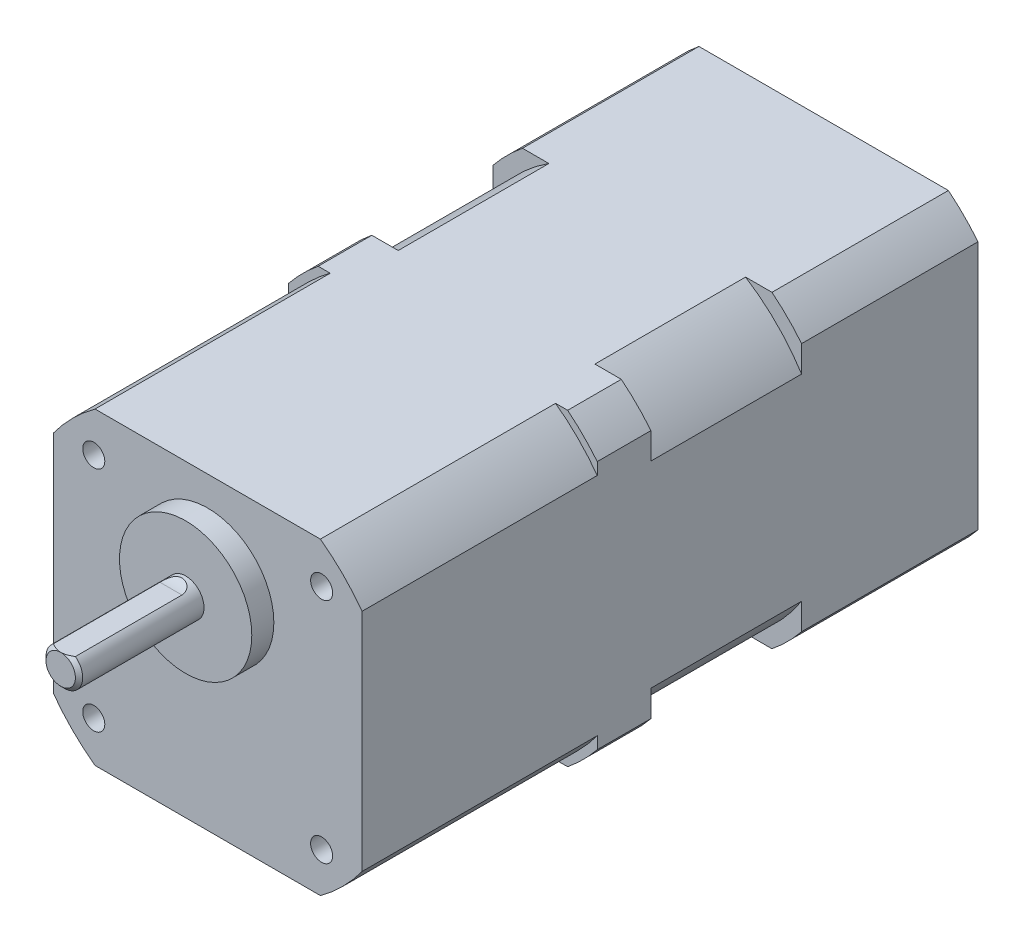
ISO-10303-21;
HEADER;
FILE_DESCRIPTION(('STEP AP214'),'2;1');
FILE_NAME('part.step','',(''),(''),'','','');
FILE_SCHEMA(('AUTOMOTIVE_DESIGN { 1 0 10303 214 1 1 1 1 }'));
ENDSEC;
DATA;
#1=APPLICATION_CONTEXT('core data for automotive mechanical design processes');
#2=APPLICATION_PROTOCOL_DEFINITION('international standard','automotive_design',2000,#1);
#3=PRODUCT_CONTEXT('',#1,'mechanical');
#4=PRODUCT('Part','Part','',(#3));
#5=PRODUCT_RELATED_PRODUCT_CATEGORY('part','',(#4));
#6=PRODUCT_DEFINITION_FORMATION('','',#4);
#7=PRODUCT_DEFINITION_CONTEXT('part definition',#1,'design');
#8=PRODUCT_DEFINITION('design','',#6,#7);
#9=PRODUCT_DEFINITION_SHAPE('','',#8);
#10=(LENGTH_UNIT() NAMED_UNIT(*) SI_UNIT(.MILLI.,.METRE.));
#11=(NAMED_UNIT(*) PLANE_ANGLE_UNIT() SI_UNIT($,.RADIAN.));
#12=(NAMED_UNIT(*) SI_UNIT($,.STERADIAN.) SOLID_ANGLE_UNIT());
#13=UNCERTAINTY_MEASURE_WITH_UNIT(LENGTH_MEASURE(1.E-05),#10,'distance_accuracy_value','');
#14=(GEOMETRIC_REPRESENTATION_CONTEXT(3) GLOBAL_UNCERTAINTY_ASSIGNED_CONTEXT((#13)) GLOBAL_UNIT_ASSIGNED_CONTEXT((#10,
#11,#12)) REPRESENTATION_CONTEXT('',''));
#15=CARTESIAN_POINT('',(0.,0.,0.));
#16=DIRECTION('',(0.,0.,1.));
#17=DIRECTION('',(1.,0.,0.));
#18=AXIS2_PLACEMENT_3D('',#15,#16,#17);
#19=CARTESIAN_POINT('',(0.,0.,-39.3));
#20=DIRECTION('',(0.,0.,-1.));
#21=DIRECTION('',(-1.,0.,0.));
#22=AXIS2_PLACEMENT_3D('',#19,#20,#21);
#23=PLANE('',#22);
#24=CARTESIAN_POINT('',(0.,-8.,-39.3));
#25=DIRECTION('',(0.,0.,-1.));
#26=DIRECTION('',(-1.,0.,0.));
#27=AXIS2_PLACEMENT_3D('',#24,#25,#26);
#28=CIRCLE('',#27,24.9);
#29=CARTESIAN_POINT('',(-13.3794618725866,-29.,-39.3));
#30=VERTEX_POINT('',#29);
#31=CARTESIAN_POINT('',(-21.,-21.3794618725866,-39.3));
#32=VERTEX_POINT('',#31);
#33=EDGE_CURVE('E402',#30,#32,#28,.T.);
#34=ORIENTED_EDGE('',*,*,#33,.F.);
#35=DIRECTION('',(-1.,0.,0.));
#36=VECTOR('',#35,1.);
#37=CARTESIAN_POINT('',(0.,-29.,-39.3));
#38=LINE('',#37,#36);
#39=CARTESIAN_POINT('',(-16.9705627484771,-29.,-39.3));
#40=VERTEX_POINT('',#39);
#41=EDGE_CURVE('E433',#30,#40,#38,.T.);
#42=ORIENTED_EDGE('',*,*,#41,.T.);
#43=CARTESIAN_POINT('',(0.,-8.,-39.3));
#44=DIRECTION('',(0.,0.,-1.));
#45=DIRECTION('',(-1.,0.,0.));
#46=AXIS2_PLACEMENT_3D('',#43,#44,#45);
#47=CIRCLE('',#46,27.);
#48=CARTESIAN_POINT('',(-21.,-24.9705627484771,-39.3));
#49=VERTEX_POINT('',#48);
#50=EDGE_CURVE('E432',#40,#49,#47,.T.);
#51=ORIENTED_EDGE('',*,*,#50,.T.);
#52=DIRECTION('',(0.,1.,0.));
#53=VECTOR('',#52,1.);
#54=CARTESIAN_POINT('',(-21.,0.,-39.3));
#55=LINE('',#54,#53);
#56=EDGE_CURVE('E436',#49,#32,#55,.T.);
#57=ORIENTED_EDGE('',*,*,#56,.T.);
#58=EDGE_LOOP('',(#34,#42,#51,#57));
#59=FACE_BOUND('',#58,.T.);
#60=ADVANCED_FACE('F87',(#59),#23,.T.);
#61=CARTESIAN_POINT('',(21.,-21.3794618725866,-39.3));
#62=VERTEX_POINT('',#61);
#63=CARTESIAN_POINT('',(13.3794618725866,-29.,-39.3));
#64=VERTEX_POINT('',#63);
#65=EDGE_CURVE('E687',#62,#64,#28,.T.);
#66=ORIENTED_EDGE('',*,*,#65,.F.);
#67=DIRECTION('',(0.,-1.,0.));
#68=VECTOR('',#67,1.);
#69=CARTESIAN_POINT('',(21.,0.,-39.3));
#70=LINE('',#69,#68);
#71=CARTESIAN_POINT('',(21.,-24.9705627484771,-39.3));
#72=VERTEX_POINT('',#71);
#73=EDGE_CURVE('E445',#62,#72,#70,.T.);
#74=ORIENTED_EDGE('',*,*,#73,.T.);
#75=CARTESIAN_POINT('',(0.,-8.,-39.3));
#76=DIRECTION('',(0.,0.,-1.));
#77=DIRECTION('',(-1.,0.,0.));
#78=AXIS2_PLACEMENT_3D('',#75,#76,#77);
#79=CIRCLE('',#78,27.);
#80=CARTESIAN_POINT('',(16.9705627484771,-29.,-39.3));
#81=VERTEX_POINT('',#80);
#82=EDGE_CURVE('E448',#72,#81,#79,.T.);
#83=ORIENTED_EDGE('',*,*,#82,.T.);
#84=EDGE_CURVE('E430',#81,#64,#38,.T.);
#85=ORIENTED_EDGE('',*,*,#84,.T.);
#86=EDGE_LOOP('',(#66,#74,#83,#85));
#87=FACE_BOUND('',#86,.T.);
#88=ADVANCED_FACE('F736',(#87),#23,.T.);
#89=CARTESIAN_POINT('',(13.3794618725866,13.,-39.3));
#90=VERTEX_POINT('',#89);
#91=CARTESIAN_POINT('',(21.,5.37946187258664,-39.3));
#92=VERTEX_POINT('',#91);
#93=EDGE_CURVE('E103',#90,#92,#28,.T.);
#94=ORIENTED_EDGE('',*,*,#93,.F.);
#95=DIRECTION('',(1.,0.,0.));
#96=VECTOR('',#95,1.);
#97=CARTESIAN_POINT('',(0.,13.,-39.3));
#98=LINE('',#97,#96);
#99=CARTESIAN_POINT('',(16.9705627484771,13.,-39.3));
#100=VERTEX_POINT('',#99);
#101=EDGE_CURVE('E440',#90,#100,#98,.T.);
#102=ORIENTED_EDGE('',*,*,#101,.T.);
#103=CARTESIAN_POINT('',(0.,-8.,-39.3));
#104=DIRECTION('',(0.,0.,-1.));
#105=DIRECTION('',(-1.,0.,0.));
#106=AXIS2_PLACEMENT_3D('',#103,#104,#105);
#107=CIRCLE('',#106,27.);
#108=CARTESIAN_POINT('',(21.,8.97056274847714,-39.3));
#109=VERTEX_POINT('',#108);
#110=EDGE_CURVE('E443',#100,#109,#107,.T.);
#111=ORIENTED_EDGE('',*,*,#110,.T.);
#112=EDGE_CURVE('E446',#109,#92,#70,.T.);
#113=ORIENTED_EDGE('',*,*,#112,.T.);
#114=EDGE_LOOP('',(#94,#102,#111,#113));
#115=FACE_BOUND('',#114,.T.);
#116=ADVANCED_FACE('F617',(#115),#23,.T.);
#117=CARTESIAN_POINT('',(0.,0.,3.));
#118=DIRECTION('',(0.,0.,-1.));
#119=DIRECTION('',(-1.,0.,0.));
#120=AXIS2_PLACEMENT_3D('',#117,#118,#119);
#121=CYLINDRICAL_SURFACE('',#120,9.);
#122=CARTESIAN_POINT('',(0.,0.,3.));
#123=DIRECTION('',(0.,0.,1.));
#124=DIRECTION('',(1.,0.,0.));
#125=AXIS2_PLACEMENT_3D('',#122,#123,#124);
#126=CIRCLE('',#125,9.);
#127=CARTESIAN_POINT('',(9.,0.,3.));
#128=VERTEX_POINT('',#127);
#129=EDGE_CURVE('E548',#128,#128,#126,.T.);
#130=ORIENTED_EDGE('',*,*,#129,.F.);
#131=EDGE_LOOP('',(#130));
#132=FACE_BOUND('',#131,.T.);
#133=CARTESIAN_POINT('',(0.,0.,0.));
#134=DIRECTION('',(0.,0.,1.));
#135=DIRECTION('',(1.,0.,0.));
#136=AXIS2_PLACEMENT_3D('',#133,#134,#135);
#137=CIRCLE('',#136,9.);
#138=CARTESIAN_POINT('',(9.,0.,0.));
#139=VERTEX_POINT('',#138);
#140=EDGE_CURVE('E539',#139,#139,#137,.T.);
#141=ORIENTED_EDGE('',*,*,#140,.T.);
#142=EDGE_LOOP('',(#141));
#143=FACE_BOUND('',#142,.T.);
#144=ADVANCED_FACE('F612',(#132,#143),#121,.T.);
#145=CARTESIAN_POINT('',(0.,0.,3.));
#146=DIRECTION('',(0.,0.,1.));
#147=DIRECTION('',(1.,0.,0.));
#148=AXIS2_PLACEMENT_3D('',#145,#146,#147);
#149=PLANE('',#148);
#150=CARTESIAN_POINT('',(0.,0.,3.));
#151=DIRECTION('',(0.,0.,1.));
#152=DIRECTION('',(1.,0.,0.));
#153=AXIS2_PLACEMENT_3D('',#150,#151,#152);
#154=CIRCLE('',#153,2.5);
#155=CARTESIAN_POINT('',(2.5,0.,3.));
#156=VERTEX_POINT('',#155);
#157=EDGE_CURVE('E549',#156,#156,#154,.T.);
#158=ORIENTED_EDGE('',*,*,#157,.F.);
#159=EDGE_LOOP('',(#158));
#160=FACE_BOUND('',#159,.T.);
#161=ORIENTED_EDGE('',*,*,#129,.T.);
#162=EDGE_LOOP('',(#161));
#163=FACE_BOUND('',#162,.T.);
#164=ADVANCED_FACE('F607',(#160,#163),#149,.T.);
#165=CARTESIAN_POINT('',(0.,0.,20.));
#166=DIRECTION('',(0.,0.,-1.));
#167=DIRECTION('',(-1.,0.,0.));
#168=AXIS2_PLACEMENT_3D('',#165,#166,#167);
#169=CYLINDRICAL_SURFACE('',#168,2.5);
#170=DIRECTION('',(0.,0.,-1.));
#171=VECTOR('',#170,1.);
#172=CARTESIAN_POINT('',(1.5,2.,20.));
#173=LINE('',#172,#171);
#174=CARTESIAN_POINT('',(1.5,2.,5.));
#175=VERTEX_POINT('',#174);
#176=CARTESIAN_POINT('',(1.5,2.,19.5));
#177=VERTEX_POINT('',#176);
#178=EDGE_CURVE('E543',#175,#177,#173,.F.);
#179=ORIENTED_EDGE('',*,*,#178,.T.);
#180=CARTESIAN_POINT('',(0.,0.,19.5));
#181=DIRECTION('',(0.,0.,1.));
#182=DIRECTION('',(1.,0.,0.));
#183=AXIS2_PLACEMENT_3D('',#180,#181,#182);
#184=CIRCLE('',#183,2.5);
#185=CARTESIAN_POINT('',(-1.5,2.,19.5));
#186=VERTEX_POINT('',#185);
#187=EDGE_CURVE('E12',#177,#186,#184,.F.);
#188=ORIENTED_EDGE('',*,*,#187,.T.);
#189=DIRECTION('',(0.,0.,-1.));
#190=VECTOR('',#189,1.);
#191=CARTESIAN_POINT('',(-1.5,2.,20.));
#192=LINE('',#191,#190);
#193=CARTESIAN_POINT('',(-1.5,2.,5.));
#194=VERTEX_POINT('',#193);
#195=EDGE_CURVE('E546',#186,#194,#192,.T.);
#196=ORIENTED_EDGE('',*,*,#195,.T.);
#197=CARTESIAN_POINT('',(-1.5,2.,5.));
#198=CARTESIAN_POINT('',(-1.49999715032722,1.99999314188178,4.95892674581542));
#199=CARTESIAN_POINT('',(-1.49865021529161,2.0010120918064,4.91785429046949));
#200=CARTESIAN_POINT('',(-1.4932483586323,2.00505117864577,4.83598328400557));
#201=CARTESIAN_POINT('',(-1.48919319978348,2.00807149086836,4.79518475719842));
#202=CARTESIAN_POINT('',(-1.47835056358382,2.01606618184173,4.71410748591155));
#203=CARTESIAN_POINT('',(-1.47156081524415,2.02104218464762,4.67382920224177));
#204=CARTESIAN_POINT('',(-1.45522246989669,2.03283738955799,4.59412385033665));
#205=CARTESIAN_POINT('',(-1.44567398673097,2.03965651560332,4.55469674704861));
#206=CARTESIAN_POINT('',(-1.41279633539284,2.06270144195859,4.43800575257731));
#207=CARTESIAN_POINT('',(-1.38523998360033,2.08151079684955,4.36237086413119));
#208=CARTESIAN_POINT('',(-1.31873332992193,2.12426241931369,4.21798498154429));
#209=CARTESIAN_POINT('',(-1.2797940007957,2.14819973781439,4.14922744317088));
#210=CARTESIAN_POINT('',(-1.19150122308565,2.19837375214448,4.02166810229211));
#211=CARTESIAN_POINT('',(-1.14234473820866,2.2245621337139,3.96271134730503));
#212=CARTESIAN_POINT('',(-1.0340484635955,2.27691680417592,3.85478819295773));
#213=CARTESIAN_POINT('',(-0.974907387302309,2.30308308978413,3.80582308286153));
#214=CARTESIAN_POINT('',(-0.849770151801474,2.35208125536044,3.71982766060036));
#215=CARTESIAN_POINT('',(-0.783987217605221,2.37498114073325,3.68252488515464));
#216=CARTESIAN_POINT('',(-0.646171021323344,2.41611971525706,3.61837007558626));
#217=CARTESIAN_POINT('',(-0.574136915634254,2.43435777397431,3.59151945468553));
#218=CARTESIAN_POINT('',(-0.424128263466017,2.46497580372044,3.54761782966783));
#219=CARTESIAN_POINT('',(-0.346056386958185,2.47721439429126,3.5308014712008));
#220=CARTESIAN_POINT('',(-0.187572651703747,2.49422805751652,3.50765769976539));
#221=CARTESIAN_POINT('',(-0.107160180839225,2.49900115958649,3.50133305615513));
#222=CARTESIAN_POINT('',(0.0569228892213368,2.50074733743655,3.49900227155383));
#223=CARTESIAN_POINT('',(0.140602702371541,2.4974215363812,3.50339152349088));
#224=CARTESIAN_POINT('',(0.305874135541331,2.48260441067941,3.5234269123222));
#225=CARTESIAN_POINT('',(0.387465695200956,2.47111285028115,3.539073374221));
#226=CARTESIAN_POINT('',(0.546475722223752,2.44088811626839,3.58199212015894));
#227=CARTESIAN_POINT('',(0.623877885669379,2.42212868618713,3.60930659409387));
#228=CARTESIAN_POINT('',(0.771757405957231,2.37914220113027,3.67579490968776));
#229=CARTESIAN_POINT('',(0.842236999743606,2.35491692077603,3.71496490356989));
#230=CARTESIAN_POINT('',(0.971781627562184,2.3044115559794,3.8033874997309));
#231=CARTESIAN_POINT('',(1.03115970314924,2.27823299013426,3.8522394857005));
#232=CARTESIAN_POINT('',(1.13991312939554,2.2258143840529,3.95997396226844));
#233=CARTESIAN_POINT('',(1.18929246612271,2.1995743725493,4.01885243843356));
#234=CARTESIAN_POINT('',(1.2760399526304,2.15038394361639,4.14345454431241));
#235=CARTESIAN_POINT('',(1.31369451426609,2.12736421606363,4.20895245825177));
#236=CARTESIAN_POINT('',(1.37859452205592,2.08589814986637,4.34635283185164));
#237=CARTESIAN_POINT('',(1.4058302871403,2.06745607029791,4.41826117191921));
#238=CARTESIAN_POINT('',(1.43999574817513,2.0436789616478,4.5328616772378));
#239=CARTESIAN_POINT('',(1.45054113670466,2.03618591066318,4.57408272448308));
#240=CARTESIAN_POINT('',(1.46858445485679,2.023211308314,4.65751363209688));
#241=CARTESIAN_POINT('',(1.4760819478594,2.01773004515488,4.6997236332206));
#242=CARTESIAN_POINT('',(1.48806028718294,2.00891381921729,4.7847875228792));
#243=CARTESIAN_POINT('',(1.49254110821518,2.00557887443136,4.82764141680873));
#244=CARTESIAN_POINT('',(1.49850899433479,2.00111793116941,4.91366338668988));
#245=CARTESIAN_POINT('',(1.4999966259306,1.99999151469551,4.95683140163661));
#246=CARTESIAN_POINT('',(1.50000000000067,1.99999999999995,4.99999999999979));
#247=B_SPLINE_CURVE_WITH_KNOTS('',3,(#197,#198,#199,#200,#201,#202,#203,#204,#205,#206,#207,
#208,#209,#210,#211,#212,#213,#214,#215,#216,#217,#218,#219,#220,#221,#222,#223,#224,#225,#226,
#227,#228,#229,#230,#231,#232,#233,#234,#235,#236,#237,#238,#239,#240,#241,#242,#243,#244,#245,
#246),.UNSPECIFIED.,.F.,.F.,(4,2,2,2,2,2,2,2,2,2,2,2,2,2,2,2,2,2,2,2,2,2,2,2,4),(0.,
0.123183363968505,0.246377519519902,0.369674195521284,0.492965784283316,0.739665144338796,
0.986127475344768,1.22821834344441,1.47034042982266,1.70628928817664,1.94227003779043,
2.18357238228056,2.42493841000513,2.67534571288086,2.92576024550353,3.17708801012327,
3.42833429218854,3.67079201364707,3.91315288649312,4.14901905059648,4.38510385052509,
4.5145729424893,4.64406057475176,4.77354929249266,4.9030135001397),.UNSPECIFIED.);
#248=EDGE_CURVE('E552',#194,#175,#247,.T.);
#249=ORIENTED_EDGE('',*,*,#248,.T.);
#250=EDGE_LOOP('',(#179,#188,#196,#249));
#251=FACE_BOUND('',#250,.T.);
#252=ORIENTED_EDGE('',*,*,#157,.T.);
#253=EDGE_LOOP('',(#252));
#254=FACE_BOUND('',#253,.T.);
#255=ADVANCED_FACE('F567',(#251,#254),#169,.T.);
#256=CARTESIAN_POINT('',(0.,0.,20.));
#257=DIRECTION('',(0.,0.,1.));
#258=DIRECTION('',(1.,0.,0.));
#259=AXIS2_PLACEMENT_3D('',#256,#257,#258);
#260=PLANE('',#259);
#261=CARTESIAN_POINT('',(0.,0.,20.));
#262=DIRECTION('',(0.,0.,1.));
#263=DIRECTION('',(1.,0.,0.));
#264=AXIS2_PLACEMENT_3D('',#261,#262,#263);
#265=CIRCLE('',#264,1.99999999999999);
#266=CARTESIAN_POINT('',(0.,2.,20.));
#267=VERTEX_POINT('',#266);
#268=EDGE_CURVE('E565',#267,#267,#265,.T.);
#269=ORIENTED_EDGE('',*,*,#268,.T.);
#270=EDGE_LOOP('',(#269));
#271=FACE_BOUND('',#270,.T.);
#272=ADVANCED_FACE('F577',(#271),#260,.T.);
#273=CARTESIAN_POINT('',(-2.5,4.5,5.));
#274=DIRECTION('',(1.,0.,0.));
#275=DIRECTION('',(0.,0.,-1.));
#276=AXIS2_PLACEMENT_3D('',#273,#274,#275);
#277=CYLINDRICAL_SURFACE('',#276,2.5);
#278=DIRECTION('',(1.,0.,0.));
#279=VECTOR('',#278,1.);
#280=CARTESIAN_POINT('',(-2.5,2.,5.));
#281=LINE('',#280,#279);
#282=EDGE_CURVE('E540',#194,#175,#281,.T.);
#283=ORIENTED_EDGE('',*,*,#282,.T.);
#284=ORIENTED_EDGE('',*,*,#248,.F.);
#285=EDGE_LOOP('',(#283,#284));
#286=FACE_BOUND('',#285,.T.);
#287=ADVANCED_FACE('F571',(#286),#277,.F.);
#288=CARTESIAN_POINT('',(-2.5,2.,0.));
#289=DIRECTION('',(0.,-1.,0.));
#290=DIRECTION('',(0.,0.,-1.));
#291=AXIS2_PLACEMENT_3D('',#288,#289,#290);
#292=PLANE('',#291);
#293=CARTESIAN_POINT('',(-1.5,2.,19.5));
#294=CARTESIAN_POINT('',(-1.42763018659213,2.,19.5433736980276));
#295=CARTESIAN_POINT('',(-1.35436226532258,2.,19.5853687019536));
#296=CARTESIAN_POINT('',(-1.20549660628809,2.,19.6656443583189));
#297=CARTESIAN_POINT('',(-1.12989157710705,2.,19.7039114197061));
#298=CARTESIAN_POINT('',(-0.978296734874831,2.,19.774534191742));
#299=CARTESIAN_POINT('',(-0.902366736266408,2.,19.8070165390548));
#300=CARTESIAN_POINT('',(-0.748220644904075,2.,19.8658090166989));
#301=CARTESIAN_POINT('',(-0.670007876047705,2.,19.8921276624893));
#302=CARTESIAN_POINT('',(-0.543060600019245,2.,19.9280861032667));
#303=CARTESIAN_POINT('',(-0.495021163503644,2.,19.9401901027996));
#304=CARTESIAN_POINT('',(-0.398260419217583,2.,19.9612794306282));
#305=CARTESIAN_POINT('',(-0.349539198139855,2.,19.9702651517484));
#306=CARTESIAN_POINT('',(-0.250852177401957,2.,19.984927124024));
#307=CARTESIAN_POINT('',(-0.200878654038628,2.,19.9905520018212));
#308=CARTESIAN_POINT('',(-0.100607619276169,2.,19.9981023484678));
#309=CARTESIAN_POINT('',(-0.0503098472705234,2.,20.0000243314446));
#310=CARTESIAN_POINT('',(0.,2.,20.));
#311=B_SPLINE_CURVE_WITH_KNOTS('',3,(#293,#294,#295,#296,#297,#298,#299,#300,#301,#302,#303,
#304,#305,#306,#307,#308,#309,#310),.UNSPECIFIED.,.F.,.F.,(4,2,2,2,2,2,2,2,4),(0.,
0.253195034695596,0.507281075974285,0.754837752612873,1.00205037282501,1.15058504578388,
1.29910100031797,1.44983263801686,1.600706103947),.UNSPECIFIED.);
#312=EDGE_CURVE('E585',#186,#267,#311,.T.);
#313=ORIENTED_EDGE('',*,*,#312,.T.);
#314=CARTESIAN_POINT('',(0.,1.99999999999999,20.));
#315=CARTESIAN_POINT('',(0.0614966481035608,2.,20.0000514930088));
#316=CARTESIAN_POINT('',(0.122961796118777,2.,19.997164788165));
#317=CARTESIAN_POINT('',(0.245274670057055,2.,19.9859212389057));
#318=CARTESIAN_POINT('',(0.306123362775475,2.,19.9775750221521));
#319=CARTESIAN_POINT('',(0.425885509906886,2.,19.9559969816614));
#320=CARTESIAN_POINT('',(0.484814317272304,2.,19.9428488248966));
#321=CARTESIAN_POINT('',(0.601555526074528,2.,19.9122507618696));
#322=CARTESIAN_POINT('',(0.659367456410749,2.,19.8947990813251));
#323=CARTESIAN_POINT('',(0.784576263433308,2.,19.8525702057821));
#324=CARTESIAN_POINT('',(0.851714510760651,2.,19.8270315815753));
#325=CARTESIAN_POINT('',(0.984250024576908,2.,19.7717452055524));
#326=CARTESIAN_POINT('',(1.04964642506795,2.,19.7419954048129));
#327=CARTESIAN_POINT('',(1.18016546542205,2.,19.6784785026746));
#328=CARTESIAN_POINT('',(1.24525271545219,2.,19.6446394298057));
#329=CARTESIAN_POINT('',(1.37378197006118,2.,19.5742160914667));
#330=CARTESIAN_POINT('',(1.43722666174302,2.,19.5376367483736));
#331=CARTESIAN_POINT('',(1.5,2.,19.5));
#332=B_SPLINE_CURVE_WITH_KNOTS('',3,(#314,#315,#316,#317,#318,#319,#320,#321,#322,#323,#324,
#325,#326,#327,#328,#329,#330,#331),.UNSPECIFIED.,.F.,.F.,(4,2,2,2,2,2,2,2,4),(0.,
0.184371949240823,0.368386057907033,0.549336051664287,0.730360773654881,0.945674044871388,
1.16109243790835,1.38109142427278,1.60070428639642),.UNSPECIFIED.);
#333=EDGE_CURVE('E96',#267,#177,#332,.T.);
#334=ORIENTED_EDGE('',*,*,#333,.T.);
#335=ORIENTED_EDGE('',*,*,#178,.F.);
#336=ORIENTED_EDGE('',*,*,#282,.F.);
#337=ORIENTED_EDGE('',*,*,#195,.F.);
#338=EDGE_LOOP('',(#313,#334,#335,#336,#337));
#339=FACE_BOUND('',#338,.T.);
#340=ADVANCED_FACE('F576',(#339),#292,.F.);
#341=CARTESIAN_POINT('',(0.,0.,20.));
#342=DIRECTION('',(0.,0.,-1.));
#343=DIRECTION('',(-1.,0.,0.));
#344=AXIS2_PLACEMENT_3D('',#341,#342,#343);
#345=CONICAL_SURFACE('',#344,1.99999999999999,0.785398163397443);
#346=ORIENTED_EDGE('',*,*,#312,.F.);
#347=ORIENTED_EDGE('',*,*,#187,.F.);
#348=ORIENTED_EDGE('',*,*,#333,.F.);
#349=ORIENTED_EDGE('',*,*,#268,.F.);
#350=EDGE_LOOP('',(#346,#347,#348,#349));
#351=FACE_BOUND('',#350,.T.);
#352=ADVANCED_FACE('F89',(#351),#345,.T.);
#353=CARTESIAN_POINT('',(-21.,0.,-32.));
#354=DIRECTION('',(1.,0.,0.));
#355=DIRECTION('',(0.,0.,-1.));
#356=AXIS2_PLACEMENT_3D('',#353,#354,#355);
#357=PLANE('',#356);
#358=DIRECTION('',(0.,1.,0.));
#359=VECTOR('',#358,1.);
#360=CARTESIAN_POINT('',(-21.,0.,0.));
#361=LINE('',#360,#359);
#362=CARTESIAN_POINT('',(-21.,-23.3297097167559,0.));
#363=VERTEX_POINT('',#362);
#364=CARTESIAN_POINT('',(-21.,7.3297097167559,0.));
#365=VERTEX_POINT('',#364);
#366=EDGE_CURVE('E497',#363,#365,#361,.T.);
#367=ORIENTED_EDGE('',*,*,#366,.T.);
#368=DIRECTION('',(0.,0.,1.));
#369=VECTOR('',#368,1.);
#370=CARTESIAN_POINT('',(-21.,7.3297097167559,-32.));
#371=LINE('',#370,#369);
#372=CARTESIAN_POINT('',(-21.,7.3297097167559,-32.));
#373=VERTEX_POINT('',#372);
#374=EDGE_CURVE('E536',#373,#365,#371,.T.);
#375=ORIENTED_EDGE('',*,*,#374,.F.);
#376=DIRECTION('',(0.,1.,0.));
#377=VECTOR('',#376,1.);
#378=CARTESIAN_POINT('',(-21.,0.,-32.));
#379=LINE('',#378,#377);
#380=CARTESIAN_POINT('',(-21.,8.97056274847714,-32.));
#381=VERTEX_POINT('',#380);
#382=EDGE_CURVE('E456',#373,#381,#379,.T.);
#383=ORIENTED_EDGE('',*,*,#382,.T.);
#384=DIRECTION('',(0.,0.,1.));
#385=VECTOR('',#384,1.);
#386=CARTESIAN_POINT('',(-21.,8.97056274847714,-39.3));
#387=LINE('',#386,#385);
#388=CARTESIAN_POINT('',(-21.,8.97056274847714,-39.3));
#389=VERTEX_POINT('',#388);
#390=EDGE_CURVE('E488',#389,#381,#387,.T.);
#391=ORIENTED_EDGE('',*,*,#390,.F.);
#392=CARTESIAN_POINT('',(-21.,5.37946187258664,-39.3));
#393=VERTEX_POINT('',#392);
#394=EDGE_CURVE('E435',#393,#389,#55,.T.);
#395=ORIENTED_EDGE('',*,*,#394,.F.);
#396=DIRECTION('',(0.,0.,1.));
#397=VECTOR('',#396,1.);
#398=CARTESIAN_POINT('',(-21.,5.37946187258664,-59.8));
#399=LINE('',#398,#397);
#400=CARTESIAN_POINT('',(-21.,5.37946187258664,-59.8));
#401=VERTEX_POINT('',#400);
#402=EDGE_CURVE('E426',#401,#393,#399,.T.);
#403=ORIENTED_EDGE('',*,*,#402,.F.);
#404=DIRECTION('',(0.,1.,0.));
#405=VECTOR('',#404,1.);
#406=CARTESIAN_POINT('',(-21.,0.,-59.8));
#407=LINE('',#406,#405);
#408=CARTESIAN_POINT('',(-21.,8.97056274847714,-59.8));
#409=VERTEX_POINT('',#408);
#410=EDGE_CURVE('E364',#401,#409,#407,.T.);
#411=ORIENTED_EDGE('',*,*,#410,.T.);
#412=DIRECTION('',(0.,0.,1.));
#413=VECTOR('',#412,1.);
#414=CARTESIAN_POINT('',(-21.,8.97056274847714,-70.3));
#415=LINE('',#414,#413);
#416=CARTESIAN_POINT('',(-21.,8.97056274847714,-83.8));
#417=VERTEX_POINT('',#416);
#418=EDGE_CURVE('E391',#417,#409,#415,.T.);
#419=ORIENTED_EDGE('',*,*,#418,.F.);
#420=DIRECTION('',(0.,1.,0.));
#421=VECTOR('',#420,1.);
#422=CARTESIAN_POINT('',(-21.,-24.9705627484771,-83.8));
#423=LINE('',#422,#421);
#424=CARTESIAN_POINT('',(-21.,-24.9705627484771,-83.8));
#425=VERTEX_POINT('',#424);
#426=EDGE_CURVE('E347',#425,#417,#423,.T.);
#427=ORIENTED_EDGE('',*,*,#426,.F.);
#428=DIRECTION('',(0.,0.,1.));
#429=VECTOR('',#428,1.);
#430=CARTESIAN_POINT('',(-21.,-24.9705627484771,-70.3));
#431=LINE('',#430,#429);
#432=CARTESIAN_POINT('',(-21.,-24.9705627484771,-59.8));
#433=VERTEX_POINT('',#432);
#434=EDGE_CURVE('E394',#425,#433,#431,.T.);
#435=ORIENTED_EDGE('',*,*,#434,.T.);
#436=CARTESIAN_POINT('',(-21.,-21.3794618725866,-59.8));
#437=VERTEX_POINT('',#436);
#438=EDGE_CURVE('E365',#433,#437,#407,.T.);
#439=ORIENTED_EDGE('',*,*,#438,.T.);
#440=DIRECTION('',(0.,0.,1.));
#441=VECTOR('',#440,1.);
#442=CARTESIAN_POINT('',(-21.,-21.3794618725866,-59.8));
#443=LINE('',#442,#441);
#444=EDGE_CURVE('E405',#437,#32,#443,.T.);
#445=ORIENTED_EDGE('',*,*,#444,.T.);
#446=ORIENTED_EDGE('',*,*,#56,.F.);
#447=DIRECTION('',(0.,0.,1.));
#448=VECTOR('',#447,1.);
#449=CARTESIAN_POINT('',(-21.,-24.9705627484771,-39.3));
#450=LINE('',#449,#448);
#451=CARTESIAN_POINT('',(-21.,-24.9705627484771,-32.));
#452=VERTEX_POINT('',#451);
#453=EDGE_CURVE('E491',#49,#452,#450,.T.);
#454=ORIENTED_EDGE('',*,*,#453,.T.);
#455=CARTESIAN_POINT('',(-21.,-23.3297097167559,-32.));
#456=VERTEX_POINT('',#455);
#457=EDGE_CURVE('E457',#452,#456,#379,.T.);
#458=ORIENTED_EDGE('',*,*,#457,.T.);
#459=DIRECTION('',(0.,0.,1.));
#460=VECTOR('',#459,1.);
#461=CARTESIAN_POINT('',(-21.,-23.3297097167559,-32.));
#462=LINE('',#461,#460);
#463=EDGE_CURVE('E519',#456,#363,#462,.T.);
#464=ORIENTED_EDGE('',*,*,#463,.T.);
#465=EDGE_LOOP('',(#367,#375,#383,#391,#395,#403,#411,#419,#427,#435,#439,#445,#446,#454,#458,#464));
#466=FACE_BOUND('',#465,.T.);
#467=ADVANCED_FACE('F579',(#466),#357,.F.);
#468=CARTESIAN_POINT('',(0.,-8.,-32.));
#469=DIRECTION('',(0.,0.,1.));
#470=DIRECTION('',(1.,0.,0.));
#471=AXIS2_PLACEMENT_3D('',#468,#469,#470);
#472=CYLINDRICAL_SURFACE('',#471,26.);
#473=CARTESIAN_POINT('',(0.,-8.,0.));
#474=DIRECTION('',(0.,0.,-1.));
#475=DIRECTION('',(-1.,0.,0.));
#476=AXIS2_PLACEMENT_3D('',#473,#474,#475);
#477=CIRCLE('',#476,26.);
#478=CARTESIAN_POINT('',(-15.3297097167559,13.,0.));
#479=VERTEX_POINT('',#478);
#480=EDGE_CURVE('E506',#365,#479,#477,.T.);
#481=ORIENTED_EDGE('',*,*,#480,.T.);
#482=DIRECTION('',(0.,0.,1.));
#483=VECTOR('',#482,1.);
#484=CARTESIAN_POINT('',(-15.3297097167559,13.,-32.));
#485=LINE('',#484,#483);
#486=CARTESIAN_POINT('',(-15.3297097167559,13.,-32.));
#487=VERTEX_POINT('',#486);
#488=EDGE_CURVE('E534',#487,#479,#485,.T.);
#489=ORIENTED_EDGE('',*,*,#488,.F.);
#490=CARTESIAN_POINT('',(0.,-8.,-32.));
#491=DIRECTION('',(0.,0.,-1.));
#492=DIRECTION('',(-1.,0.,0.));
#493=AXIS2_PLACEMENT_3D('',#490,#491,#492);
#494=CIRCLE('',#493,26.);
#495=EDGE_CURVE('E498',#373,#487,#494,.T.);
#496=ORIENTED_EDGE('',*,*,#495,.F.);
#497=ORIENTED_EDGE('',*,*,#374,.T.);
#498=EDGE_LOOP('',(#481,#489,#496,#497));
#499=FACE_BOUND('',#498,.T.);
#500=ADVANCED_FACE('F759',(#499),#472,.T.);
#501=CARTESIAN_POINT('',(0.,13.,-32.));
#502=DIRECTION('',(0.,1.,0.));
#503=DIRECTION('',(0.,0.,1.));
#504=AXIS2_PLACEMENT_3D('',#501,#502,#503);
#505=PLANE('',#504);
#506=DIRECTION('',(-1.,0.,0.));
#507=VECTOR('',#506,1.);
#508=CARTESIAN_POINT('',(0.,13.,0.));
#509=LINE('',#508,#507);
#510=CARTESIAN_POINT('',(15.3297097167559,13.,0.));
#511=VERTEX_POINT('',#510);
#512=EDGE_CURVE('E509',#511,#479,#509,.T.);
#513=ORIENTED_EDGE('',*,*,#512,.F.);
#514=DIRECTION('',(0.,0.,1.));
#515=VECTOR('',#514,1.);
#516=CARTESIAN_POINT('',(15.3297097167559,13.,-32.));
#517=LINE('',#516,#515);
#518=CARTESIAN_POINT('',(15.3297097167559,13.,-32.));
#519=VERTEX_POINT('',#518);
#520=EDGE_CURVE('E532',#519,#511,#517,.T.);
#521=ORIENTED_EDGE('',*,*,#520,.F.);
#522=DIRECTION('',(1.,0.,0.));
#523=VECTOR('',#522,1.);
#524=CARTESIAN_POINT('',(0.,13.,-32.));
#525=LINE('',#524,#523);
#526=CARTESIAN_POINT('',(16.9705627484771,13.,-32.));
#527=VERTEX_POINT('',#526);
#528=EDGE_CURVE('E462',#519,#527,#525,.T.);
#529=ORIENTED_EDGE('',*,*,#528,.T.);
#530=DIRECTION('',(0.,0.,1.));
#531=VECTOR('',#530,1.);
#532=CARTESIAN_POINT('',(16.9705627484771,13.,-39.3));
#533=LINE('',#532,#531);
#534=EDGE_CURVE('E482',#100,#527,#533,.T.);
#535=ORIENTED_EDGE('',*,*,#534,.F.);
#536=ORIENTED_EDGE('',*,*,#101,.F.);
#537=DIRECTION('',(0.,0.,1.));
#538=VECTOR('',#537,1.);
#539=CARTESIAN_POINT('',(13.3794618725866,13.,-59.8));
#540=LINE('',#539,#538);
#541=CARTESIAN_POINT('',(13.3794618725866,13.,-59.8));
#542=VERTEX_POINT('',#541);
#543=EDGE_CURVE('E420',#542,#90,#540,.T.);
#544=ORIENTED_EDGE('',*,*,#543,.F.);
#545=DIRECTION('',(1.,0.,0.));
#546=VECTOR('',#545,1.);
#547=CARTESIAN_POINT('',(0.,13.,-59.8));
#548=LINE('',#547,#546);
#549=CARTESIAN_POINT('',(16.9705627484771,13.,-59.8));
#550=VERTEX_POINT('',#549);
#551=EDGE_CURVE('E370',#542,#550,#548,.T.);
#552=ORIENTED_EDGE('',*,*,#551,.T.);
#553=DIRECTION('',(0.,0.,1.));
#554=VECTOR('',#553,1.);
#555=CARTESIAN_POINT('',(16.9705627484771,13.,-70.3));
#556=LINE('',#555,#554);
#557=CARTESIAN_POINT('',(16.9705627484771,13.,-83.8));
#558=VERTEX_POINT('',#557);
#559=EDGE_CURVE('E385',#558,#550,#556,.T.);
#560=ORIENTED_EDGE('',*,*,#559,.F.);
#561=DIRECTION('',(1.,0.,0.));
#562=VECTOR('',#561,1.);
#563=CARTESIAN_POINT('',(-16.9705627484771,13.,-83.8));
#564=LINE('',#563,#562);
#565=CARTESIAN_POINT('',(-16.9705627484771,13.,-83.8));
#566=VERTEX_POINT('',#565);
#567=EDGE_CURVE('E353',#566,#558,#564,.T.);
#568=ORIENTED_EDGE('',*,*,#567,.F.);
#569=DIRECTION('',(0.,0.,1.));
#570=VECTOR('',#569,1.);
#571=CARTESIAN_POINT('',(-16.9705627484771,13.,-70.3));
#572=LINE('',#571,#570);
#573=CARTESIAN_POINT('',(-16.9705627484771,13.,-59.8));
#574=VERTEX_POINT('',#573);
#575=EDGE_CURVE('E388',#566,#574,#572,.T.);
#576=ORIENTED_EDGE('',*,*,#575,.T.);
#577=CARTESIAN_POINT('',(-13.3794618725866,13.,-59.8));
#578=VERTEX_POINT('',#577);
#579=EDGE_CURVE('E371',#574,#578,#548,.T.);
#580=ORIENTED_EDGE('',*,*,#579,.T.);
#581=DIRECTION('',(0.,0.,1.));
#582=VECTOR('',#581,1.);
#583=CARTESIAN_POINT('',(-13.3794618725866,13.,-59.8));
#584=LINE('',#583,#582);
#585=CARTESIAN_POINT('',(-13.3794618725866,13.,-39.3));
#586=VERTEX_POINT('',#585);
#587=EDGE_CURVE('E423',#578,#586,#584,.T.);
#588=ORIENTED_EDGE('',*,*,#587,.T.);
#589=CARTESIAN_POINT('',(-16.9705627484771,13.,-39.3));
#590=VERTEX_POINT('',#589);
#591=EDGE_CURVE('E441',#590,#586,#98,.T.);
#592=ORIENTED_EDGE('',*,*,#591,.F.);
#593=DIRECTION('',(0.,0.,1.));
#594=VECTOR('',#593,1.);
#595=CARTESIAN_POINT('',(-16.9705627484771,13.,-39.3));
#596=LINE('',#595,#594);
#597=CARTESIAN_POINT('',(-16.9705627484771,13.,-32.));
#598=VERTEX_POINT('',#597);
#599=EDGE_CURVE('E485',#590,#598,#596,.T.);
#600=ORIENTED_EDGE('',*,*,#599,.T.);
#601=EDGE_CURVE('E463',#598,#487,#525,.T.);
#602=ORIENTED_EDGE('',*,*,#601,.T.);
#603=ORIENTED_EDGE('',*,*,#488,.T.);
#604=EDGE_LOOP('',(#513,#521,#529,#535,#536,#544,#552,#560,#568,#576,#580,#588,#592,#600,#602,#603));
#605=FACE_BOUND('',#604,.T.);
#606=ADVANCED_FACE('F667',(#605),#505,.T.);
#607=CARTESIAN_POINT('',(21.,7.3297097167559,0.));
#608=VERTEX_POINT('',#607);
#609=EDGE_CURVE('E510',#511,#608,#477,.T.);
#610=ORIENTED_EDGE('',*,*,#609,.T.);
#611=DIRECTION('',(0.,0.,1.));
#612=VECTOR('',#611,1.);
#613=CARTESIAN_POINT('',(21.,7.3297097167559,-32.));
#614=LINE('',#613,#612);
#615=CARTESIAN_POINT('',(21.,7.3297097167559,-32.));
#616=VERTEX_POINT('',#615);
#617=EDGE_CURVE('E530',#616,#608,#614,.T.);
#618=ORIENTED_EDGE('',*,*,#617,.F.);
#619=EDGE_CURVE('E501',#519,#616,#494,.T.);
#620=ORIENTED_EDGE('',*,*,#619,.F.);
#621=ORIENTED_EDGE('',*,*,#520,.T.);
#622=EDGE_LOOP('',(#610,#618,#620,#621));
#623=FACE_BOUND('',#622,.T.);
#624=ADVANCED_FACE('F669',(#623),#472,.T.);
#625=CARTESIAN_POINT('',(21.,0.,-32.));
#626=DIRECTION('',(1.,0.,0.));
#627=DIRECTION('',(0.,0.,-1.));
#628=AXIS2_PLACEMENT_3D('',#625,#626,#627);
#629=PLANE('',#628);
#630=DIRECTION('',(0.,1.,0.));
#631=VECTOR('',#630,1.);
#632=CARTESIAN_POINT('',(21.,0.,0.));
#633=LINE('',#632,#631);
#634=CARTESIAN_POINT('',(21.,-23.3297097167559,0.));
#635=VERTEX_POINT('',#634);
#636=EDGE_CURVE('E513',#635,#608,#633,.T.);
#637=ORIENTED_EDGE('',*,*,#636,.F.);
#638=DIRECTION('',(0.,0.,1.));
#639=VECTOR('',#638,1.);
#640=CARTESIAN_POINT('',(21.,-23.3297097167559,-32.));
#641=LINE('',#640,#639);
#642=CARTESIAN_POINT('',(21.,-23.3297097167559,-32.));
#643=VERTEX_POINT('',#642);
#644=EDGE_CURVE('E528',#643,#635,#641,.T.);
#645=ORIENTED_EDGE('',*,*,#644,.F.);
#646=DIRECTION('',(0.,-1.,0.));
#647=VECTOR('',#646,1.);
#648=CARTESIAN_POINT('',(21.,0.,-32.));
#649=LINE('',#648,#647);
#650=CARTESIAN_POINT('',(21.,-24.9705627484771,-32.));
#651=VERTEX_POINT('',#650);
#652=EDGE_CURVE('E468',#643,#651,#649,.T.);
#653=ORIENTED_EDGE('',*,*,#652,.T.);
#654=DIRECTION('',(0.,0.,1.));
#655=VECTOR('',#654,1.);
#656=CARTESIAN_POINT('',(21.,-24.9705627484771,-39.3));
#657=LINE('',#656,#655);
#658=EDGE_CURVE('E476',#72,#651,#657,.T.);
#659=ORIENTED_EDGE('',*,*,#658,.F.);
#660=ORIENTED_EDGE('',*,*,#73,.F.);
#661=DIRECTION('',(0.,0.,1.));
#662=VECTOR('',#661,1.);
#663=CARTESIAN_POINT('',(21.,-21.3794618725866,-59.8));
#664=LINE('',#663,#662);
#665=CARTESIAN_POINT('',(21.,-21.3794618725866,-59.8));
#666=VERTEX_POINT('',#665);
#667=EDGE_CURVE('E414',#666,#62,#664,.T.);
#668=ORIENTED_EDGE('',*,*,#667,.F.);
#669=DIRECTION('',(0.,-1.,0.));
#670=VECTOR('',#669,1.);
#671=CARTESIAN_POINT('',(21.,0.,-59.8));
#672=LINE('',#671,#670);
#673=CARTESIAN_POINT('',(21.,-24.9705627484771,-59.8));
#674=VERTEX_POINT('',#673);
#675=EDGE_CURVE('E376',#666,#674,#672,.T.);
#676=ORIENTED_EDGE('',*,*,#675,.T.);
#677=DIRECTION('',(0.,0.,1.));
#678=VECTOR('',#677,1.);
#679=CARTESIAN_POINT('',(21.,-24.9705627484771,-70.3));
#680=LINE('',#679,#678);
#681=CARTESIAN_POINT('',(21.,-24.9705627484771,-83.8));
#682=VERTEX_POINT('',#681);
#683=EDGE_CURVE('E322',#682,#674,#680,.T.);
#684=ORIENTED_EDGE('',*,*,#683,.F.);
#685=DIRECTION('',(0.,-1.,0.));
#686=VECTOR('',#685,1.);
#687=CARTESIAN_POINT('',(21.,8.97056274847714,-83.8));
#688=LINE('',#687,#686);
#689=CARTESIAN_POINT('',(21.,8.97056274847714,-83.8));
#690=VERTEX_POINT('',#689);
#691=EDGE_CURVE('E338',#690,#682,#688,.T.);
#692=ORIENTED_EDGE('',*,*,#691,.F.);
#693=DIRECTION('',(0.,0.,1.));
#694=VECTOR('',#693,1.);
#695=CARTESIAN_POINT('',(21.,8.97056274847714,-70.3));
#696=LINE('',#695,#694);
#697=CARTESIAN_POINT('',(21.,8.97056274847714,-59.8));
#698=VERTEX_POINT('',#697);
#699=EDGE_CURVE('E382',#690,#698,#696,.T.);
#700=ORIENTED_EDGE('',*,*,#699,.T.);
#701=CARTESIAN_POINT('',(21.,5.37946187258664,-59.8));
#702=VERTEX_POINT('',#701);
#703=EDGE_CURVE('E377',#698,#702,#672,.T.);
#704=ORIENTED_EDGE('',*,*,#703,.T.);
#705=DIRECTION('',(0.,0.,1.));
#706=VECTOR('',#705,1.);
#707=CARTESIAN_POINT('',(21.,5.37946187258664,-59.8));
#708=LINE('',#707,#706);
#709=EDGE_CURVE('E417',#702,#92,#708,.T.);
#710=ORIENTED_EDGE('',*,*,#709,.T.);
#711=ORIENTED_EDGE('',*,*,#112,.F.);
#712=DIRECTION('',(0.,0.,1.));
#713=VECTOR('',#712,1.);
#714=CARTESIAN_POINT('',(21.,8.97056274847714,-39.3));
#715=LINE('',#714,#713);
#716=CARTESIAN_POINT('',(21.,8.97056274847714,-32.));
#717=VERTEX_POINT('',#716);
#718=EDGE_CURVE('E479',#109,#717,#715,.T.);
#719=ORIENTED_EDGE('',*,*,#718,.T.);
#720=EDGE_CURVE('E469',#717,#616,#649,.T.);
#721=ORIENTED_EDGE('',*,*,#720,.T.);
#722=ORIENTED_EDGE('',*,*,#617,.T.);
#723=EDGE_LOOP('',(#637,#645,#653,#659,#660,#668,#676,#684,#692,#700,#704,#710,#711,#719,#721,#722));
#724=FACE_BOUND('',#723,.T.);
#725=ADVANCED_FACE('F657',(#724),#629,.T.);
#726=CARTESIAN_POINT('',(15.3297097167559,-29.,0.));
#727=VERTEX_POINT('',#726);
#728=EDGE_CURVE('E516',#635,#727,#477,.T.);
#729=ORIENTED_EDGE('',*,*,#728,.T.);
#730=DIRECTION('',(0.,0.,1.));
#731=VECTOR('',#730,1.);
#732=CARTESIAN_POINT('',(15.3297097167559,-29.,-32.));
#733=LINE('',#732,#731);
#734=CARTESIAN_POINT('',(15.3297097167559,-29.,-32.));
#735=VERTEX_POINT('',#734);
#736=EDGE_CURVE('E525',#735,#727,#733,.T.);
#737=ORIENTED_EDGE('',*,*,#736,.F.);
#738=EDGE_CURVE('E641',#643,#735,#494,.T.);
#739=ORIENTED_EDGE('',*,*,#738,.F.);
#740=ORIENTED_EDGE('',*,*,#644,.T.);
#741=EDGE_LOOP('',(#729,#737,#739,#740));
#742=FACE_BOUND('',#741,.T.);
#743=ADVANCED_FACE('F672',(#742),#472,.T.);
#744=CARTESIAN_POINT('',(0.,-29.,-32.));
#745=DIRECTION('',(0.,1.,0.));
#746=DIRECTION('',(0.,0.,1.));
#747=AXIS2_PLACEMENT_3D('',#744,#745,#746);
#748=PLANE('',#747);
#749=DIRECTION('',(-1.,0.,0.));
#750=VECTOR('',#749,1.);
#751=CARTESIAN_POINT('',(0.,-29.,0.));
#752=LINE('',#751,#750);
#753=CARTESIAN_POINT('',(-15.3297097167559,-29.,0.));
#754=VERTEX_POINT('',#753);
#755=EDGE_CURVE('E517',#727,#754,#752,.T.);
#756=ORIENTED_EDGE('',*,*,#755,.T.);
#757=DIRECTION('',(0.,0.,1.));
#758=VECTOR('',#757,1.);
#759=CARTESIAN_POINT('',(-15.3297097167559,-29.,-32.));
#760=LINE('',#759,#758);
#761=CARTESIAN_POINT('',(-15.3297097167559,-29.,-32.));
#762=VERTEX_POINT('',#761);
#763=EDGE_CURVE('E522',#762,#754,#760,.T.);
#764=ORIENTED_EDGE('',*,*,#763,.F.);
#765=DIRECTION('',(-1.,0.,0.));
#766=VECTOR('',#765,1.);
#767=CARTESIAN_POINT('',(0.,-29.,-32.));
#768=LINE('',#767,#766);
#769=CARTESIAN_POINT('',(-16.9705627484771,-29.,-32.));
#770=VERTEX_POINT('',#769);
#771=EDGE_CURVE('E429',#762,#770,#768,.T.);
#772=ORIENTED_EDGE('',*,*,#771,.T.);
#773=DIRECTION('',(0.,0.,1.));
#774=VECTOR('',#773,1.);
#775=CARTESIAN_POINT('',(-16.9705627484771,-29.,-39.3));
#776=LINE('',#775,#774);
#777=EDGE_CURVE('E494',#40,#770,#776,.T.);
#778=ORIENTED_EDGE('',*,*,#777,.F.);
#779=ORIENTED_EDGE('',*,*,#41,.F.);
#780=DIRECTION('',(0.,0.,1.));
#781=VECTOR('',#780,1.);
#782=CARTESIAN_POINT('',(-13.3794618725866,-29.,-59.8));
#783=LINE('',#782,#781);
#784=CARTESIAN_POINT('',(-13.3794618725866,-29.,-59.8));
#785=VERTEX_POINT('',#784);
#786=EDGE_CURVE('E408',#785,#30,#783,.T.);
#787=ORIENTED_EDGE('',*,*,#786,.F.);
#788=DIRECTION('',(-1.,0.,0.));
#789=VECTOR('',#788,1.);
#790=CARTESIAN_POINT('',(0.,-29.,-59.8));
#791=LINE('',#790,#789);
#792=CARTESIAN_POINT('',(-16.9705627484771,-29.,-59.8));
#793=VERTEX_POINT('',#792);
#794=EDGE_CURVE('E359',#785,#793,#791,.T.);
#795=ORIENTED_EDGE('',*,*,#794,.T.);
#796=DIRECTION('',(0.,0.,1.));
#797=VECTOR('',#796,1.);
#798=CARTESIAN_POINT('',(-16.9705627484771,-29.,-70.3));
#799=LINE('',#798,#797);
#800=CARTESIAN_POINT('',(-16.9705627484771,-29.,-83.8));
#801=VERTEX_POINT('',#800);
#802=EDGE_CURVE('E328',#801,#793,#799,.T.);
#803=ORIENTED_EDGE('',*,*,#802,.F.);
#804=DIRECTION('',(-1.,0.,0.));
#805=VECTOR('',#804,1.);
#806=CARTESIAN_POINT('',(16.9705627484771,-29.,-83.8));
#807=LINE('',#806,#805);
#808=CARTESIAN_POINT('',(16.9705627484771,-29.,-83.8));
#809=VERTEX_POINT('',#808);
#810=EDGE_CURVE('E325',#809,#801,#807,.T.);
#811=ORIENTED_EDGE('',*,*,#810,.F.);
#812=DIRECTION('',(0.,0.,1.));
#813=VECTOR('',#812,1.);
#814=CARTESIAN_POINT('',(16.9705627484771,-29.,-70.3));
#815=LINE('',#814,#813);
#816=CARTESIAN_POINT('',(16.9705627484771,-29.,-59.8));
#817=VERTEX_POINT('',#816);
#818=EDGE_CURVE('E311',#809,#817,#815,.T.);
#819=ORIENTED_EDGE('',*,*,#818,.T.);
#820=CARTESIAN_POINT('',(13.3794618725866,-29.,-59.8));
#821=VERTEX_POINT('',#820);
#822=EDGE_CURVE('E360',#817,#821,#791,.T.);
#823=ORIENTED_EDGE('',*,*,#822,.T.);
#824=DIRECTION('',(0.,0.,1.));
#825=VECTOR('',#824,1.);
#826=CARTESIAN_POINT('',(13.3794618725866,-29.,-59.8));
#827=LINE('',#826,#825);
#828=EDGE_CURVE('E411',#821,#64,#827,.T.);
#829=ORIENTED_EDGE('',*,*,#828,.T.);
#830=ORIENTED_EDGE('',*,*,#84,.F.);
#831=DIRECTION('',(0.,0.,1.));
#832=VECTOR('',#831,1.);
#833=CARTESIAN_POINT('',(16.9705627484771,-29.,-39.3));
#834=LINE('',#833,#832);
#835=CARTESIAN_POINT('',(16.9705627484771,-29.,-32.));
#836=VERTEX_POINT('',#835);
#837=EDGE_CURVE('E450',#81,#836,#834,.T.);
#838=ORIENTED_EDGE('',*,*,#837,.T.);
#839=EDGE_CURVE('E451',#836,#735,#768,.T.);
#840=ORIENTED_EDGE('',*,*,#839,.T.);
#841=ORIENTED_EDGE('',*,*,#736,.T.);
#842=EDGE_LOOP('',(#756,#764,#772,#778,#779,#787,#795,#803,#811,#819,#823,#829,#830,#838,#840,#841));
#843=FACE_BOUND('',#842,.T.);
#844=ADVANCED_FACE('F326',(#843),#748,.F.);
#845=EDGE_CURVE('E502',#754,#363,#477,.T.);
#846=ORIENTED_EDGE('',*,*,#845,.T.);
#847=ORIENTED_EDGE('',*,*,#463,.F.);
#848=EDGE_CURVE('E503',#762,#456,#494,.T.);
#849=ORIENTED_EDGE('',*,*,#848,.F.);
#850=ORIENTED_EDGE('',*,*,#763,.T.);
#851=EDGE_LOOP('',(#846,#847,#849,#850));
#852=FACE_BOUND('',#851,.T.);
#853=ADVANCED_FACE('F624',(#852),#472,.T.);
#854=CARTESIAN_POINT('',(0.,0.,0.));
#855=DIRECTION('',(0.,0.,-1.));
#856=DIRECTION('',(-1.,0.,0.));
#857=AXIS2_PLACEMENT_3D('',#854,#855,#856);
#858=PLANE('',#857);
#859=CARTESIAN_POINT('',(15.5,-23.5,0.));
#860=DIRECTION('',(0.,0.,1.));
#861=DIRECTION('',(1.,0.,0.));
#862=AXIS2_PLACEMENT_3D('',#859,#860,#861);
#863=CIRCLE('',#862,1.5);
#864=CARTESIAN_POINT('',(17.,-23.5,0.));
#865=VERTEX_POINT('',#864);
#866=EDGE_CURVE('E1221',#865,#865,#863,.T.);
#867=ORIENTED_EDGE('',*,*,#866,.F.);
#868=EDGE_LOOP('',(#867));
#869=FACE_BOUND('',#868,.T.);
#870=CARTESIAN_POINT('',(-15.5,-23.5,0.));
#871=DIRECTION('',(0.,0.,1.));
#872=DIRECTION('',(1.,0.,0.));
#873=AXIS2_PLACEMENT_3D('',#870,#871,#872);
#874=CIRCLE('',#873,1.5);
#875=CARTESIAN_POINT('',(-14.,-23.5,0.));
#876=VERTEX_POINT('',#875);
#877=EDGE_CURVE('E1220',#876,#876,#874,.T.);
#878=ORIENTED_EDGE('',*,*,#877,.F.);
#879=EDGE_LOOP('',(#878));
#880=FACE_BOUND('',#879,.T.);
#881=CARTESIAN_POINT('',(-15.5,7.5,0.));
#882=DIRECTION('',(0.,0.,1.));
#883=DIRECTION('',(1.,0.,0.));
#884=AXIS2_PLACEMENT_3D('',#881,#882,#883);
#885=CIRCLE('',#884,1.5);
#886=CARTESIAN_POINT('',(-14.,7.5,0.));
#887=VERTEX_POINT('',#886);
#888=EDGE_CURVE('E1231',#887,#887,#885,.T.);
#889=ORIENTED_EDGE('',*,*,#888,.F.);
#890=EDGE_LOOP('',(#889));
#891=FACE_BOUND('',#890,.T.);
#892=CARTESIAN_POINT('',(15.5,7.5,0.));
#893=DIRECTION('',(0.,0.,1.));
#894=DIRECTION('',(1.,0.,0.));
#895=AXIS2_PLACEMENT_3D('',#892,#893,#894);
#896=CIRCLE('',#895,1.5);
#897=CARTESIAN_POINT('',(17.,7.5,0.));
#898=VERTEX_POINT('',#897);
#899=EDGE_CURVE('E342',#898,#898,#896,.T.);
#900=ORIENTED_EDGE('',*,*,#899,.F.);
#901=EDGE_LOOP('',(#900));
#902=FACE_BOUND('',#901,.T.);
#903=ORIENTED_EDGE('',*,*,#140,.F.);
#904=EDGE_LOOP('',(#903));
#905=FACE_BOUND('',#904,.T.);
#906=ORIENTED_EDGE('',*,*,#366,.F.);
#907=ORIENTED_EDGE('',*,*,#845,.F.);
#908=ORIENTED_EDGE('',*,*,#755,.F.);
#909=ORIENTED_EDGE('',*,*,#728,.F.);
#910=ORIENTED_EDGE('',*,*,#636,.T.);
#911=ORIENTED_EDGE('',*,*,#609,.F.);
#912=ORIENTED_EDGE('',*,*,#512,.T.);
#913=ORIENTED_EDGE('',*,*,#480,.F.);
#914=EDGE_LOOP('',(#906,#907,#908,#909,#910,#911,#912,#913));
#915=FACE_BOUND('',#914,.T.);
#916=ADVANCED_FACE('F620',(#869,#880,#891,#902,#905,#915),#858,.F.);
#917=CARTESIAN_POINT('',(0.,0.,-32.));
#918=DIRECTION('',(0.,0.,-1.));
#919=DIRECTION('',(-1.,0.,0.));
#920=AXIS2_PLACEMENT_3D('',#917,#918,#919);
#921=PLANE('',#920);
#922=ORIENTED_EDGE('',*,*,#382,.F.);
#923=ORIENTED_EDGE('',*,*,#495,.T.);
#924=ORIENTED_EDGE('',*,*,#601,.F.);
#925=CARTESIAN_POINT('',(0.,-8.,-32.));
#926=DIRECTION('',(0.,0.,-1.));
#927=DIRECTION('',(-1.,0.,0.));
#928=AXIS2_PLACEMENT_3D('',#925,#926,#927);
#929=CIRCLE('',#928,27.);
#930=EDGE_CURVE('E460',#381,#598,#929,.T.);
#931=ORIENTED_EDGE('',*,*,#930,.F.);
#932=EDGE_LOOP('',(#922,#923,#924,#931));
#933=FACE_BOUND('',#932,.T.);
#934=ADVANCED_FACE('F623',(#933),#921,.F.);
#935=ORIENTED_EDGE('',*,*,#528,.F.);
#936=ORIENTED_EDGE('',*,*,#619,.T.);
#937=ORIENTED_EDGE('',*,*,#720,.F.);
#938=CARTESIAN_POINT('',(0.,-8.,-32.));
#939=DIRECTION('',(0.,0.,-1.));
#940=DIRECTION('',(-1.,0.,0.));
#941=AXIS2_PLACEMENT_3D('',#938,#939,#940);
#942=CIRCLE('',#941,27.);
#943=EDGE_CURVE('E466',#527,#717,#942,.T.);
#944=ORIENTED_EDGE('',*,*,#943,.F.);
#945=EDGE_LOOP('',(#935,#936,#937,#944));
#946=FACE_BOUND('',#945,.T.);
#947=ADVANCED_FACE('F652',(#946),#921,.F.);
#948=ORIENTED_EDGE('',*,*,#652,.F.);
#949=ORIENTED_EDGE('',*,*,#738,.T.);
#950=ORIENTED_EDGE('',*,*,#839,.F.);
#951=CARTESIAN_POINT('',(0.,-8.,-32.));
#952=DIRECTION('',(0.,0.,-1.));
#953=DIRECTION('',(-1.,0.,0.));
#954=AXIS2_PLACEMENT_3D('',#951,#952,#953);
#955=CIRCLE('',#954,27.);
#956=EDGE_CURVE('E472',#651,#836,#955,.T.);
#957=ORIENTED_EDGE('',*,*,#956,.F.);
#958=EDGE_LOOP('',(#948,#949,#950,#957));
#959=FACE_BOUND('',#958,.T.);
#960=ADVANCED_FACE('F676',(#959),#921,.F.);
#961=CARTESIAN_POINT('',(0.,-8.,-39.3));
#962=DIRECTION('',(0.,0.,1.));
#963=DIRECTION('',(1.,0.,0.));
#964=AXIS2_PLACEMENT_3D('',#961,#962,#963);
#965=CYLINDRICAL_SURFACE('',#964,27.);
#966=ORIENTED_EDGE('',*,*,#943,.T.);
#967=ORIENTED_EDGE('',*,*,#718,.F.);
#968=ORIENTED_EDGE('',*,*,#110,.F.);
#969=ORIENTED_EDGE('',*,*,#534,.T.);
#970=EDGE_LOOP('',(#966,#967,#968,#969));
#971=FACE_BOUND('',#970,.T.);
#972=ADVANCED_FACE('F663',(#971),#965,.T.);
#973=ORIENTED_EDGE('',*,*,#771,.F.);
#974=ORIENTED_EDGE('',*,*,#848,.T.);
#975=ORIENTED_EDGE('',*,*,#457,.F.);
#976=CARTESIAN_POINT('',(0.,-8.,-32.));
#977=DIRECTION('',(0.,0.,-1.));
#978=DIRECTION('',(-1.,0.,0.));
#979=AXIS2_PLACEMENT_3D('',#976,#977,#978);
#980=CIRCLE('',#979,27.);
#981=EDGE_CURVE('E454',#770,#452,#980,.T.);
#982=ORIENTED_EDGE('',*,*,#981,.F.);
#983=EDGE_LOOP('',(#973,#974,#975,#982));
#984=FACE_BOUND('',#983,.T.);
#985=ADVANCED_FACE('F639',(#984),#921,.F.);
#986=EDGE_CURVE('E111',#393,#586,#28,.T.);
#987=ORIENTED_EDGE('',*,*,#986,.F.);
#988=ORIENTED_EDGE('',*,*,#394,.T.);
#989=CARTESIAN_POINT('',(0.,-8.,-39.3));
#990=DIRECTION('',(0.,0.,-1.));
#991=DIRECTION('',(-1.,0.,0.));
#992=AXIS2_PLACEMENT_3D('',#989,#990,#991);
#993=CIRCLE('',#992,27.);
#994=EDGE_CURVE('E438',#389,#590,#993,.T.);
#995=ORIENTED_EDGE('',*,*,#994,.T.);
#996=ORIENTED_EDGE('',*,*,#591,.T.);
#997=EDGE_LOOP('',(#987,#988,#995,#996));
#998=FACE_BOUND('',#997,.T.);
#999=ADVANCED_FACE('F732',(#998),#23,.T.);
#1000=CARTESIAN_POINT('',(0.,-8.,-39.3));
#1001=DIRECTION('',(0.,0.,1.));
#1002=DIRECTION('',(1.,0.,0.));
#1003=AXIS2_PLACEMENT_3D('',#1000,#1001,#1002);
#1004=CYLINDRICAL_SURFACE('',#1003,27.);
#1005=ORIENTED_EDGE('',*,*,#930,.T.);
#1006=ORIENTED_EDGE('',*,*,#599,.F.);
#1007=ORIENTED_EDGE('',*,*,#994,.F.);
#1008=ORIENTED_EDGE('',*,*,#390,.T.);
#1009=EDGE_LOOP('',(#1005,#1006,#1007,#1008));
#1010=FACE_BOUND('',#1009,.T.);
#1011=ADVANCED_FACE('F724',(#1010),#1004,.T.);
#1012=CARTESIAN_POINT('',(0.,-8.,-39.3));
#1013=DIRECTION('',(0.,0.,1.));
#1014=DIRECTION('',(1.,0.,0.));
#1015=AXIS2_PLACEMENT_3D('',#1012,#1013,#1014);
#1016=CYLINDRICAL_SURFACE('',#1015,27.);
#1017=ORIENTED_EDGE('',*,*,#981,.T.);
#1018=ORIENTED_EDGE('',*,*,#453,.F.);
#1019=ORIENTED_EDGE('',*,*,#50,.F.);
#1020=ORIENTED_EDGE('',*,*,#777,.T.);
#1021=EDGE_LOOP('',(#1017,#1018,#1019,#1020));
#1022=FACE_BOUND('',#1021,.T.);
#1023=ADVANCED_FACE('F722',(#1022),#1016,.T.);
#1024=CARTESIAN_POINT('',(0.,-8.,-39.3));
#1025=DIRECTION('',(0.,0.,1.));
#1026=DIRECTION('',(1.,0.,0.));
#1027=AXIS2_PLACEMENT_3D('',#1024,#1025,#1026);
#1028=CYLINDRICAL_SURFACE('',#1027,27.);
#1029=ORIENTED_EDGE('',*,*,#956,.T.);
#1030=ORIENTED_EDGE('',*,*,#837,.F.);
#1031=ORIENTED_EDGE('',*,*,#82,.F.);
#1032=ORIENTED_EDGE('',*,*,#658,.T.);
#1033=EDGE_LOOP('',(#1029,#1030,#1031,#1032));
#1034=FACE_BOUND('',#1033,.T.);
#1035=ADVANCED_FACE('F678',(#1034),#1028,.T.);
#1036=CARTESIAN_POINT('',(0.,-8.,-59.8));
#1037=DIRECTION('',(0.,0.,1.));
#1038=DIRECTION('',(1.,0.,0.));
#1039=AXIS2_PLACEMENT_3D('',#1036,#1037,#1038);
#1040=CYLINDRICAL_SURFACE('',#1039,24.9);
#1041=ORIENTED_EDGE('',*,*,#986,.T.);
#1042=ORIENTED_EDGE('',*,*,#587,.F.);
#1043=CARTESIAN_POINT('',(0.,-8.,-59.8));
#1044=DIRECTION('',(0.,0.,-1.));
#1045=DIRECTION('',(-1.,0.,0.));
#1046=AXIS2_PLACEMENT_3D('',#1043,#1044,#1045);
#1047=CIRCLE('',#1046,24.9);
#1048=EDGE_CURVE('E398',#401,#578,#1047,.T.);
#1049=ORIENTED_EDGE('',*,*,#1048,.F.);
#1050=ORIENTED_EDGE('',*,*,#402,.T.);
#1051=EDGE_LOOP('',(#1041,#1042,#1049,#1050));
#1052=FACE_BOUND('',#1051,.T.);
#1053=ADVANCED_FACE('F730',(#1052),#1040,.T.);
#1054=ORIENTED_EDGE('',*,*,#93,.T.);
#1055=ORIENTED_EDGE('',*,*,#709,.F.);
#1056=EDGE_CURVE('E401',#542,#702,#1047,.T.);
#1057=ORIENTED_EDGE('',*,*,#1056,.F.);
#1058=ORIENTED_EDGE('',*,*,#543,.T.);
#1059=EDGE_LOOP('',(#1054,#1055,#1057,#1058));
#1060=FACE_BOUND('',#1059,.T.);
#1061=ADVANCED_FACE('F703',(#1060),#1040,.T.);
#1062=ORIENTED_EDGE('',*,*,#65,.T.);
#1063=ORIENTED_EDGE('',*,*,#828,.F.);
#1064=EDGE_CURVE('E689',#666,#821,#1047,.T.);
#1065=ORIENTED_EDGE('',*,*,#1064,.F.);
#1066=ORIENTED_EDGE('',*,*,#667,.T.);
#1067=EDGE_LOOP('',(#1062,#1063,#1065,#1066));
#1068=FACE_BOUND('',#1067,.T.);
#1069=ADVANCED_FACE('F686',(#1068),#1040,.T.);
#1070=ORIENTED_EDGE('',*,*,#33,.T.);
#1071=ORIENTED_EDGE('',*,*,#444,.F.);
#1072=EDGE_CURVE('E403',#785,#437,#1047,.T.);
#1073=ORIENTED_EDGE('',*,*,#1072,.F.);
#1074=ORIENTED_EDGE('',*,*,#786,.T.);
#1075=EDGE_LOOP('',(#1070,#1071,#1073,#1074));
#1076=FACE_BOUND('',#1075,.T.);
#1077=ADVANCED_FACE('F706',(#1076),#1040,.T.);
#1078=CARTESIAN_POINT('',(0.,0.,-59.8));
#1079=DIRECTION('',(0.,0.,-1.));
#1080=DIRECTION('',(-1.,0.,0.));
#1081=AXIS2_PLACEMENT_3D('',#1078,#1079,#1080);
#1082=PLANE('',#1081);
#1083=ORIENTED_EDGE('',*,*,#410,.F.);
#1084=ORIENTED_EDGE('',*,*,#1048,.T.);
#1085=ORIENTED_EDGE('',*,*,#579,.F.);
#1086=CARTESIAN_POINT('',(0.,-8.,-59.8));
#1087=DIRECTION('',(0.,0.,-1.));
#1088=DIRECTION('',(-1.,0.,0.));
#1089=AXIS2_PLACEMENT_3D('',#1086,#1087,#1088);
#1090=CIRCLE('',#1089,27.);
#1091=EDGE_CURVE('E368',#409,#574,#1090,.T.);
#1092=ORIENTED_EDGE('',*,*,#1091,.F.);
#1093=EDGE_LOOP('',(#1083,#1084,#1085,#1092));
#1094=FACE_BOUND('',#1093,.T.);
#1095=ADVANCED_FACE('F995',(#1094),#1082,.F.);
#1096=ORIENTED_EDGE('',*,*,#551,.F.);
#1097=ORIENTED_EDGE('',*,*,#1056,.T.);
#1098=ORIENTED_EDGE('',*,*,#703,.F.);
#1099=CARTESIAN_POINT('',(0.,-8.,-59.8));
#1100=DIRECTION('',(0.,0.,-1.));
#1101=DIRECTION('',(-1.,0.,0.));
#1102=AXIS2_PLACEMENT_3D('',#1099,#1100,#1101);
#1103=CIRCLE('',#1102,27.);
#1104=EDGE_CURVE('E374',#550,#698,#1103,.T.);
#1105=ORIENTED_EDGE('',*,*,#1104,.F.);
#1106=EDGE_LOOP('',(#1096,#1097,#1098,#1105));
#1107=FACE_BOUND('',#1106,.T.);
#1108=ADVANCED_FACE('F700',(#1107),#1082,.F.);
#1109=ORIENTED_EDGE('',*,*,#675,.F.);
#1110=ORIENTED_EDGE('',*,*,#1064,.T.);
#1111=ORIENTED_EDGE('',*,*,#822,.F.);
#1112=CARTESIAN_POINT('',(0.,-8.,-59.8));
#1113=DIRECTION('',(0.,0.,-1.));
#1114=DIRECTION('',(-1.,0.,0.));
#1115=AXIS2_PLACEMENT_3D('',#1112,#1113,#1114);
#1116=CIRCLE('',#1115,27.);
#1117=EDGE_CURVE('E318',#674,#817,#1116,.T.);
#1118=ORIENTED_EDGE('',*,*,#1117,.F.);
#1119=EDGE_LOOP('',(#1109,#1110,#1111,#1118));
#1120=FACE_BOUND('',#1119,.T.);
#1121=ADVANCED_FACE('F692',(#1120),#1082,.F.);
#1122=CARTESIAN_POINT('',(0.,-8.,-70.3));
#1123=DIRECTION('',(0.,0.,1.));
#1124=DIRECTION('',(1.,0.,0.));
#1125=AXIS2_PLACEMENT_3D('',#1122,#1123,#1124);
#1126=CYLINDRICAL_SURFACE('',#1125,27.);
#1127=CARTESIAN_POINT('',(0.,-8.,-59.8));
#1128=DIRECTION('',(0.,0.,-1.));
#1129=DIRECTION('',(-1.,0.,0.));
#1130=AXIS2_PLACEMENT_3D('',#1127,#1128,#1129);
#1131=CIRCLE('',#1130,27.);
#1132=EDGE_CURVE('E362',#793,#433,#1131,.T.);
#1133=ORIENTED_EDGE('',*,*,#1132,.T.);
#1134=ORIENTED_EDGE('',*,*,#434,.F.);
#1135=CARTESIAN_POINT('',(0.,-8.,-83.8));
#1136=DIRECTION('',(0.,0.,-1.));
#1137=DIRECTION('',(-1.,0.,0.));
#1138=AXIS2_PLACEMENT_3D('',#1135,#1136,#1137);
#1139=CIRCLE('',#1138,27.);
#1140=EDGE_CURVE('E332',#801,#425,#1139,.T.);
#1141=ORIENTED_EDGE('',*,*,#1140,.F.);
#1142=ORIENTED_EDGE('',*,*,#802,.T.);
#1143=EDGE_LOOP('',(#1133,#1134,#1141,#1142));
#1144=FACE_BOUND('',#1143,.T.);
#1145=ADVANCED_FACE('F1022',(#1144),#1126,.T.);
#1146=CARTESIAN_POINT('',(0.,-8.,-70.3));
#1147=DIRECTION('',(0.,0.,1.));
#1148=DIRECTION('',(1.,0.,0.));
#1149=AXIS2_PLACEMENT_3D('',#1146,#1147,#1148);
#1150=CYLINDRICAL_SURFACE('',#1149,27.);
#1151=ORIENTED_EDGE('',*,*,#1091,.T.);
#1152=ORIENTED_EDGE('',*,*,#575,.F.);
#1153=CARTESIAN_POINT('',(0.,-8.,-83.8));
#1154=DIRECTION('',(0.,0.,-1.));
#1155=DIRECTION('',(-1.,0.,0.));
#1156=AXIS2_PLACEMENT_3D('',#1153,#1154,#1155);
#1157=CIRCLE('',#1156,27.);
#1158=EDGE_CURVE('E350',#417,#566,#1157,.T.);
#1159=ORIENTED_EDGE('',*,*,#1158,.F.);
#1160=ORIENTED_EDGE('',*,*,#418,.T.);
#1161=EDGE_LOOP('',(#1151,#1152,#1159,#1160));
#1162=FACE_BOUND('',#1161,.T.);
#1163=ADVANCED_FACE('F1142',(#1162),#1150,.T.);
#1164=CARTESIAN_POINT('',(0.,-8.,-70.3));
#1165=DIRECTION('',(0.,0.,1.));
#1166=DIRECTION('',(1.,0.,0.));
#1167=AXIS2_PLACEMENT_3D('',#1164,#1165,#1166);
#1168=CYLINDRICAL_SURFACE('',#1167,27.);
#1169=ORIENTED_EDGE('',*,*,#1104,.T.);
#1170=ORIENTED_EDGE('',*,*,#699,.F.);
#1171=CARTESIAN_POINT('',(0.,-8.,-83.8));
#1172=DIRECTION('',(0.,0.,-1.));
#1173=DIRECTION('',(-1.,0.,0.));
#1174=AXIS2_PLACEMENT_3D('',#1171,#1172,#1173);
#1175=CIRCLE('',#1174,27.);
#1176=EDGE_CURVE('E356',#558,#690,#1175,.T.);
#1177=ORIENTED_EDGE('',*,*,#1176,.F.);
#1178=ORIENTED_EDGE('',*,*,#559,.T.);
#1179=EDGE_LOOP('',(#1169,#1170,#1177,#1178));
#1180=FACE_BOUND('',#1179,.T.);
#1181=ADVANCED_FACE('F1131',(#1180),#1168,.T.);
#1182=CARTESIAN_POINT('',(0.,-8.,-70.3));
#1183=DIRECTION('',(0.,0.,1.));
#1184=DIRECTION('',(1.,0.,0.));
#1185=AXIS2_PLACEMENT_3D('',#1182,#1183,#1184);
#1186=CYLINDRICAL_SURFACE('',#1185,27.);
#1187=ORIENTED_EDGE('',*,*,#1117,.T.);
#1188=ORIENTED_EDGE('',*,*,#818,.F.);
#1189=CARTESIAN_POINT('',(0.,-8.,-83.8));
#1190=DIRECTION('',(0.,0.,-1.));
#1191=DIRECTION('',(-1.,0.,0.));
#1192=AXIS2_PLACEMENT_3D('',#1189,#1190,#1191);
#1193=CIRCLE('',#1192,27.);
#1194=EDGE_CURVE('E316',#682,#809,#1193,.T.);
#1195=ORIENTED_EDGE('',*,*,#1194,.F.);
#1196=ORIENTED_EDGE('',*,*,#683,.T.);
#1197=EDGE_LOOP('',(#1187,#1188,#1195,#1196));
#1198=FACE_BOUND('',#1197,.T.);
#1199=ADVANCED_FACE('F313',(#1198),#1186,.T.);
#1200=ORIENTED_EDGE('',*,*,#794,.F.);
#1201=ORIENTED_EDGE('',*,*,#1072,.T.);
#1202=ORIENTED_EDGE('',*,*,#438,.F.);
#1203=ORIENTED_EDGE('',*,*,#1132,.F.);
#1204=EDGE_LOOP('',(#1200,#1201,#1202,#1203));
#1205=FACE_BOUND('',#1204,.T.);
#1206=ADVANCED_FACE('F717',(#1205),#1082,.F.);
#1207=CARTESIAN_POINT('',(0.,-8.,-83.8));
#1208=DIRECTION('',(0.,0.,-1.));
#1209=DIRECTION('',(-1.,0.,0.));
#1210=AXIS2_PLACEMENT_3D('',#1207,#1208,#1209);
#1211=PLANE('',#1210);
#1212=ORIENTED_EDGE('',*,*,#1194,.T.);
#1213=ORIENTED_EDGE('',*,*,#810,.T.);
#1214=ORIENTED_EDGE('',*,*,#1140,.T.);
#1215=ORIENTED_EDGE('',*,*,#426,.T.);
#1216=ORIENTED_EDGE('',*,*,#1158,.T.);
#1217=ORIENTED_EDGE('',*,*,#567,.T.);
#1218=ORIENTED_EDGE('',*,*,#1176,.T.);
#1219=ORIENTED_EDGE('',*,*,#691,.T.);
#1220=EDGE_LOOP('',(#1212,#1213,#1214,#1215,#1216,#1217,#1218,#1219));
#1221=FACE_BOUND('',#1220,.T.);
#1222=ADVANCED_FACE('F335',(#1221),#1211,.T.);
#1223=CARTESIAN_POINT('',(15.5,7.5,-7.));
#1224=DIRECTION('',(0.,0.,1.));
#1225=DIRECTION('',(1.,0.,0.));
#1226=AXIS2_PLACEMENT_3D('',#1223,#1224,#1225);
#1227=CYLINDRICAL_SURFACE('',#1226,1.5);
#1228=CARTESIAN_POINT('',(15.5,7.5,-7.));
#1229=DIRECTION('',(0.,0.,1.));
#1230=DIRECTION('',(1.,0.,0.));
#1231=AXIS2_PLACEMENT_3D('',#1228,#1229,#1230);
#1232=CIRCLE('',#1231,1.5);
#1233=CARTESIAN_POINT('',(17.,7.5,-7.));
#1234=VERTEX_POINT('',#1233);
#1235=EDGE_CURVE('E339',#1234,#1234,#1232,.T.);
#1236=ORIENTED_EDGE('',*,*,#1235,.F.);
#1237=EDGE_LOOP('',(#1236));
#1238=FACE_BOUND('',#1237,.T.);
#1239=ORIENTED_EDGE('',*,*,#899,.T.);
#1240=EDGE_LOOP('',(#1239));
#1241=FACE_BOUND('',#1240,.T.);
#1242=ADVANCED_FACE('F1043',(#1238,#1241),#1227,.F.);
#1243=CARTESIAN_POINT('',(15.5,7.5,-7.));
#1244=DIRECTION('',(0.,0.,1.));
#1245=DIRECTION('',(1.,0.,0.));
#1246=AXIS2_PLACEMENT_3D('',#1243,#1244,#1245);
#1247=PLANE('',#1246);
#1248=ORIENTED_EDGE('',*,*,#1235,.T.);
#1249=EDGE_LOOP('',(#1248));
#1250=FACE_BOUND('',#1249,.T.);
#1251=ADVANCED_FACE('F1049',(#1250),#1247,.T.);
#1252=CARTESIAN_POINT('',(-15.5,7.5,-7.));
#1253=DIRECTION('',(0.,0.,1.));
#1254=DIRECTION('',(1.,0.,0.));
#1255=AXIS2_PLACEMENT_3D('',#1252,#1253,#1254);
#1256=CYLINDRICAL_SURFACE('',#1255,1.5);
#1257=CARTESIAN_POINT('',(-15.5,7.5,-7.));
#1258=DIRECTION('',(0.,0.,1.));
#1259=DIRECTION('',(1.,0.,0.));
#1260=AXIS2_PLACEMENT_3D('',#1257,#1258,#1259);
#1261=CIRCLE('',#1260,1.5);
#1262=CARTESIAN_POINT('',(-14.,7.5,-7.));
#1263=VERTEX_POINT('',#1262);
#1264=EDGE_CURVE('E1234',#1263,#1263,#1261,.T.);
#1265=ORIENTED_EDGE('',*,*,#1264,.F.);
#1266=EDGE_LOOP('',(#1265));
#1267=FACE_BOUND('',#1266,.T.);
#1268=ORIENTED_EDGE('',*,*,#888,.T.);
#1269=EDGE_LOOP('',(#1268));
#1270=FACE_BOUND('',#1269,.T.);
#1271=ADVANCED_FACE('F1057',(#1267,#1270),#1256,.F.);
#1272=CARTESIAN_POINT('',(-15.5,7.5,-7.));
#1273=DIRECTION('',(0.,0.,1.));
#1274=DIRECTION('',(1.,0.,0.));
#1275=AXIS2_PLACEMENT_3D('',#1272,#1273,#1274);
#1276=PLANE('',#1275);
#1277=ORIENTED_EDGE('',*,*,#1264,.T.);
#1278=EDGE_LOOP('',(#1277));
#1279=FACE_BOUND('',#1278,.T.);
#1280=ADVANCED_FACE('F1065',(#1279),#1276,.T.);
#1281=CARTESIAN_POINT('',(-15.5,-23.5,-7.));
#1282=DIRECTION('',(0.,0.,1.));
#1283=DIRECTION('',(1.,0.,0.));
#1284=AXIS2_PLACEMENT_3D('',#1281,#1282,#1283);
#1285=CYLINDRICAL_SURFACE('',#1284,1.5);
#1286=CARTESIAN_POINT('',(-15.5,-23.5,-7.));
#1287=DIRECTION('',(0.,0.,1.));
#1288=DIRECTION('',(1.,0.,0.));
#1289=AXIS2_PLACEMENT_3D('',#1286,#1287,#1288);
#1290=CIRCLE('',#1289,1.5);
#1291=CARTESIAN_POINT('',(-14.,-23.5,-7.));
#1292=VERTEX_POINT('',#1291);
#1293=EDGE_CURVE('E1224',#1292,#1292,#1290,.T.);
#1294=ORIENTED_EDGE('',*,*,#1293,.F.);
#1295=EDGE_LOOP('',(#1294));
#1296=FACE_BOUND('',#1295,.T.);
#1297=ORIENTED_EDGE('',*,*,#877,.T.);
#1298=EDGE_LOOP('',(#1297));
#1299=FACE_BOUND('',#1298,.T.);
#1300=ADVANCED_FACE('F1073',(#1296,#1299),#1285,.F.);
#1301=CARTESIAN_POINT('',(-15.5,-23.5,-7.));
#1302=DIRECTION('',(0.,0.,1.));
#1303=DIRECTION('',(1.,0.,0.));
#1304=AXIS2_PLACEMENT_3D('',#1301,#1302,#1303);
#1305=PLANE('',#1304);
#1306=ORIENTED_EDGE('',*,*,#1293,.T.);
#1307=EDGE_LOOP('',(#1306));
#1308=FACE_BOUND('',#1307,.T.);
#1309=ADVANCED_FACE('F1081',(#1308),#1305,.T.);
#1310=CARTESIAN_POINT('',(15.5,-23.5,-7.));
#1311=DIRECTION('',(0.,0.,1.));
#1312=DIRECTION('',(1.,0.,0.));
#1313=AXIS2_PLACEMENT_3D('',#1310,#1311,#1312);
#1314=CYLINDRICAL_SURFACE('',#1313,1.5);
#1315=CARTESIAN_POINT('',(15.5,-23.5,-7.));
#1316=DIRECTION('',(0.,0.,1.));
#1317=DIRECTION('',(1.,0.,0.));
#1318=AXIS2_PLACEMENT_3D('',#1315,#1316,#1317);
#1319=CIRCLE('',#1318,1.5);
#1320=CARTESIAN_POINT('',(17.,-23.5,-7.));
#1321=VERTEX_POINT('',#1320);
#1322=EDGE_CURVE('E1219',#1321,#1321,#1319,.T.);
#1323=ORIENTED_EDGE('',*,*,#1322,.F.);
#1324=EDGE_LOOP('',(#1323));
#1325=FACE_BOUND('',#1324,.T.);
#1326=ORIENTED_EDGE('',*,*,#866,.T.);
#1327=EDGE_LOOP('',(#1326));
#1328=FACE_BOUND('',#1327,.T.);
#1329=ADVANCED_FACE('F1089',(#1325,#1328),#1314,.F.);
#1330=CARTESIAN_POINT('',(15.5,-23.5,-7.));
#1331=DIRECTION('',(0.,0.,1.));
#1332=DIRECTION('',(1.,0.,0.));
#1333=AXIS2_PLACEMENT_3D('',#1330,#1331,#1332);
#1334=PLANE('',#1333);
#1335=ORIENTED_EDGE('',*,*,#1322,.T.);
#1336=EDGE_LOOP('',(#1335));
#1337=FACE_BOUND('',#1336,.T.);
#1338=ADVANCED_FACE('F1097',(#1337),#1334,.T.);
#1339=CLOSED_SHELL('',(#60,#88,#116,#144,#164,#255,#272,#287,#340,#352,#467,#500,#606,#624,#725,
#743,#844,#853,#916,#934,#947,#960,#972,#985,#999,#1011,#1023,#1035,#1053,#1061,#1069,#1077,
#1095,#1108,#1121,#1145,#1163,#1181,#1199,#1206,#1222,#1242,#1251,#1271,#1280,#1300,#1309,#1329,#1338));
#1340=MANIFOLD_SOLID_BREP('B2',#1339);
#1341=ADVANCED_BREP_SHAPE_REPRESENTATION('',(#18,#1340),#14);
#1342=SHAPE_DEFINITION_REPRESENTATION(#9,#1341);
ENDSEC;
END-ISO-10303-21;
